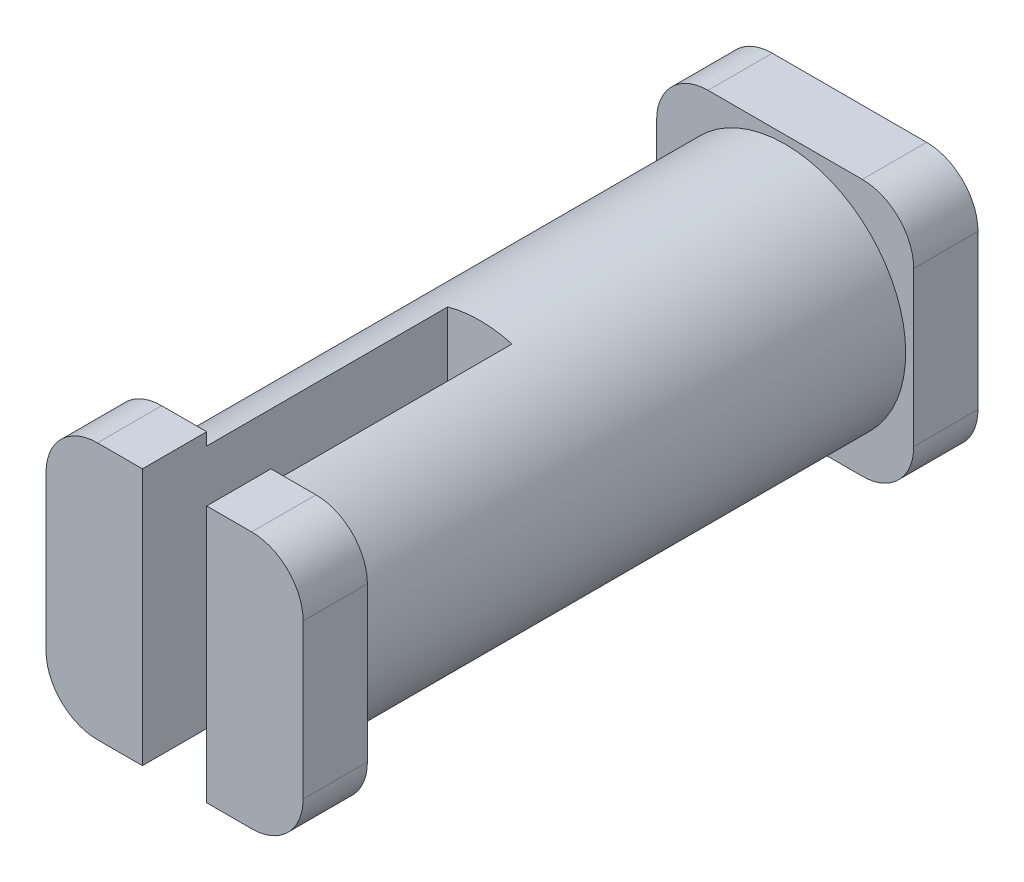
from build123d import *

# Parameters (mm, degrees)
BOSS_EXTRUDE1_DEPTH = 1.5875
SKETCH2_R           = 2.9765625
BOSS_EXTRUDE2_DEPTH = 13.49375
SKETCH3_W           = 1.5875
SKETCH3_H           = 6.35
CUT_EXTRUDE1_DEPTH  = 7.540625


with BuildPart() as part:
    # Sketch1 → Boss-Extrude1 (new body)
    with BuildSketch(Plane.XY):
        with BuildLine():
            Line((1.27, 0), (5.08, 0))
            ThreePointArc((5.08, 0), (5.978025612, 0.371974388), (6.35, 1.27))
            Line((6.35, 1.27), (6.35, 5.08))
            ThreePointArc((6.35, 5.08), (5.978025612, 5.978025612), (5.08, 6.35))
            Line((5.08, 6.35), (1.27, 6.35))
            ThreePointArc((1.27, 6.35), (0.371974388, 5.978025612), (0, 5.08))
            Line((0, 5.08), (0, 1.27))
            ThreePointArc((0, 1.27), (0.371974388, 0.371974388), (1.27, 0))
        make_face()
    boss_extrude1 = extrude(amount=BOSS_EXTRUDE1_DEPTH)

    # Sketch2 → Boss-Extrude2 (add)
    with BuildSketch(Plane.XY.offset(1.5875)):
        with Locations((3.175, 3.175)):
            Circle(SKETCH2_R)
    extrude(amount=BOSS_EXTRUDE2_DEPTH)

    # Mirror1: Boss-Extrude1 across plane
    add(boss_extrude1.mirror(Plane.XY.offset(8.334375)))

    # Sketch3 → Cut-Extrude1 (cut)
    with BuildSketch(Plane.XY.offset(16.66875)):
        with Locations((3.175, 3.175)):
            Rectangle(SKETCH3_W, SKETCH3_H)
    extrude(amount=-CUT_EXTRUDE1_DEPTH, mode=Mode.SUBTRACT)


solid = part.part
